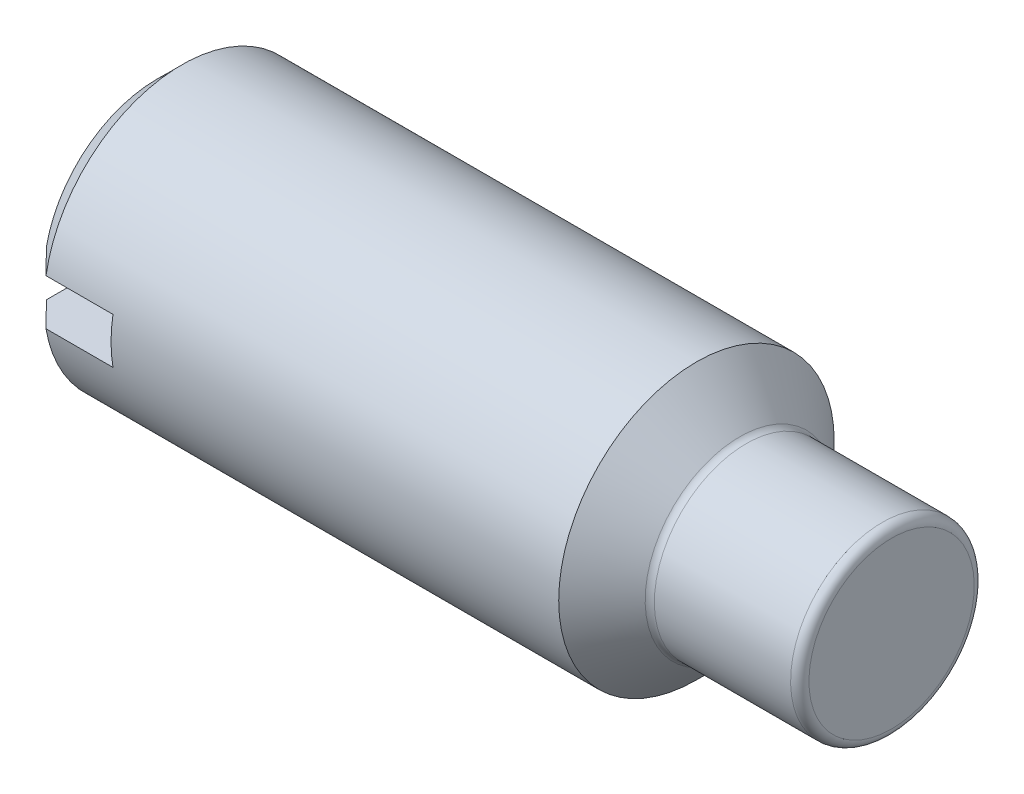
from build123d import *

# Parameters (mm, degrees)
NOTCH_DEPTH      = 17.552945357
NOTCH_DEPTH_BACK = 17.552945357
SKETCH2_W        = 2
SKETCH2_H        = 1
FILLET1_R        = 0.2
CHAMFER1_SIZE    = 0.5415


with BuildPart() as part:
    # Sketch1 → Base (revolve)
    with BuildSketch(Plane.XY, mode=Mode.PRIVATE) as base_sk:
        Polygon((16, 0), (0, 0), (0, 3), (11.75, 3), (12.75, 2), (16, 2), align=None)
    revolve(base_sk.sketch.rotate(Axis((-8.57033571, 0, 0), (1, 0, 0)), 180), axis=Axis((-8.57033571, 0, 0), (1, 0, 0)))

    # Sketch2 → Notch (cut, two sides: drawn at the far end of the back side and taken through both)
    with BuildSketch(Plane.XY.offset(-NOTCH_DEPTH_BACK)):
        with Locations((1, 0)):
            Rectangle(SKETCH2_W, SKETCH2_H)
    extrude(amount=NOTCH_DEPTH + NOTCH_DEPTH_BACK, mode=Mode.SUBTRACT)

    # Fillet1
    fillet1_edges = [part.edges().sort_by_distance(p)[0] for p in [
        (12.75, 2, 0),
        (16, 2, 0),
    ]]
    fillet(fillet1_edges, radius=FILLET1_R)

    # Chamfer1
    chamfer1_edges = [part.edges().sort_by_distance(p)[0] for p in [
        (0, 3, 0),
        (0, -2.291287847, 1.936491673),
    ]]
    chamfer(chamfer1_edges, length=CHAMFER1_SIZE)


solid = part.part
